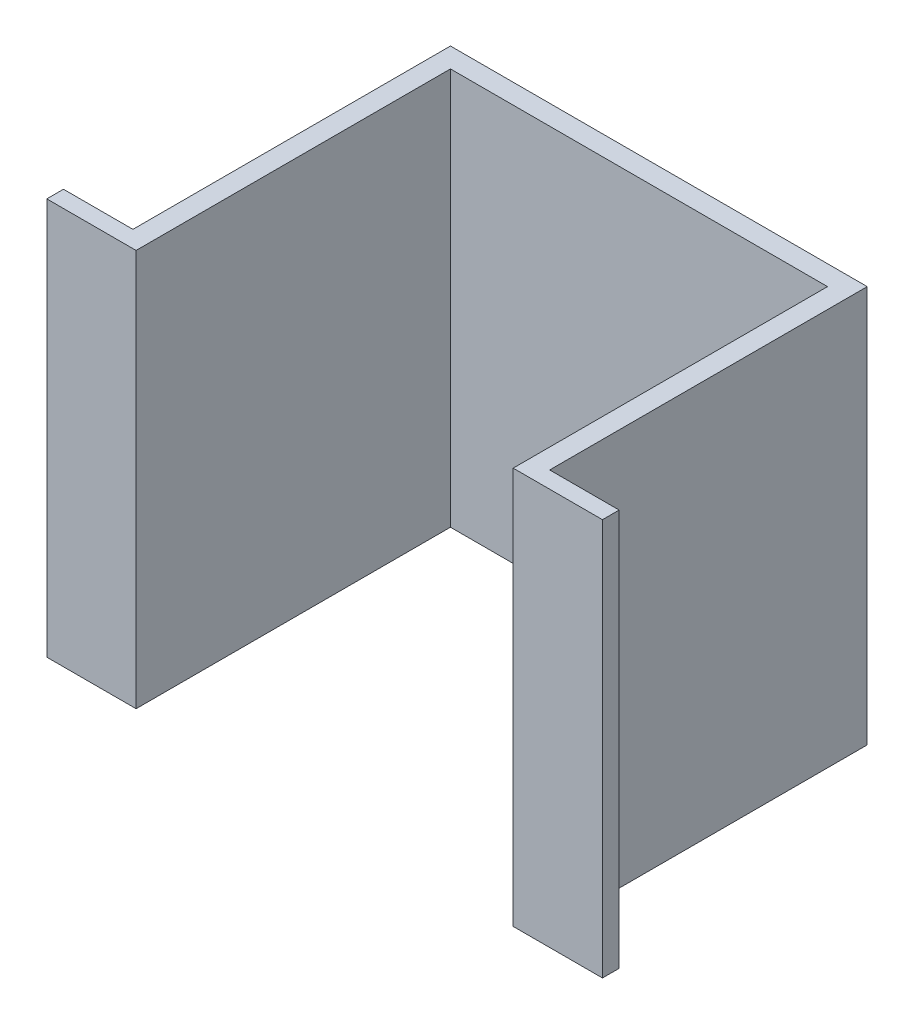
from build123d import *

# Parameters (mm, degrees)
SKETCH1_W           = 42
SKETCH1_H           = 40
BOSS_EXTRUDE1_DEPTH = 2
BOSS_EXTRUDE2_DEPTH = 40


with BuildPart() as part:
    # Sketch1 → Boss-Extrude1 (new body)
    with BuildSketch(Plane.XY):
        Rectangle(SKETCH1_W, SKETCH1_H)
    extrude(amount=BOSS_EXTRUDE1_DEPTH)

    # Sketch2 → Boss-Extrude2 (add, through all)
    with BuildSketch(Plane(origin=(0, 20, 0), x_dir=(1, 0, 0), z_dir=(0, 1, 0))):
        Polygon((-21, -2), (-21, -32), (-28, -32), (-28, -33.681429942), (-19, -33.681429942), (-19, -32), (-19, -2), align=None)
        Polygon((19, -2), (19, -32), (19, -33.681429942), (28, -33.681429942), (28, -32), (21, -32), (21, -2), align=None)
    extrude(amount=-BOSS_EXTRUDE2_DEPTH)


solid = part.part
